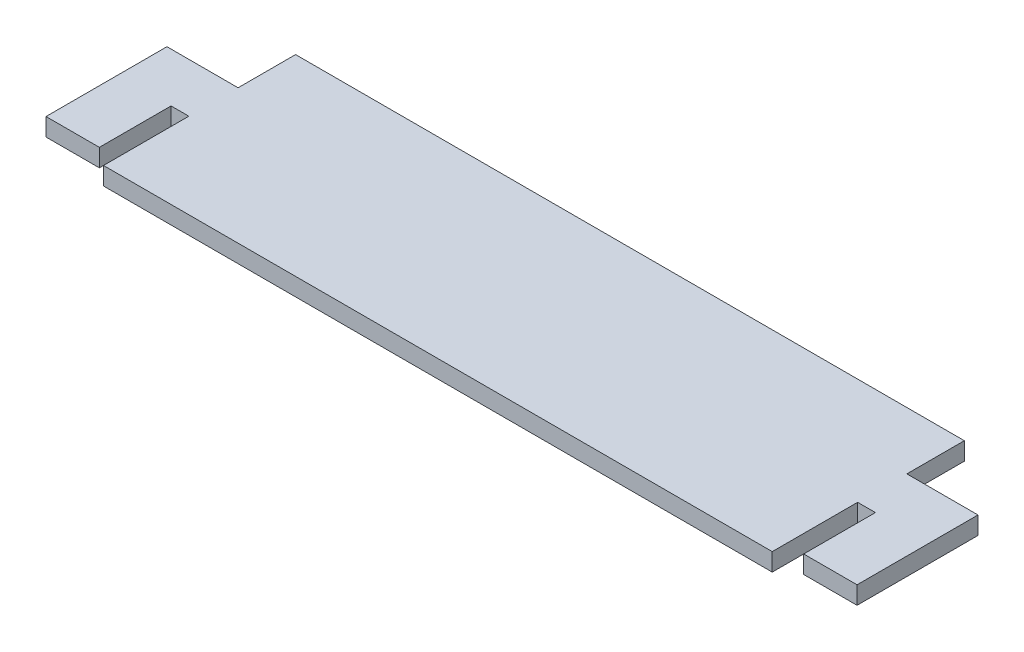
ISO-10303-21;
HEADER;
FILE_DESCRIPTION(('STEP AP214'),'2;1');
FILE_NAME('part.step','',(''),(''),'','','');
FILE_SCHEMA(('AUTOMOTIVE_DESIGN { 1 0 10303 214 1 1 1 1 }'));
ENDSEC;
DATA;
#1=APPLICATION_CONTEXT('core data for automotive mechanical design processes');
#2=APPLICATION_PROTOCOL_DEFINITION('international standard','automotive_design',2000,#1);
#3=PRODUCT_CONTEXT('',#1,'mechanical');
#4=PRODUCT('Part','Part','',(#3));
#5=PRODUCT_RELATED_PRODUCT_CATEGORY('part','',(#4));
#6=PRODUCT_DEFINITION_FORMATION('','',#4);
#7=PRODUCT_DEFINITION_CONTEXT('part definition',#1,'design');
#8=PRODUCT_DEFINITION('design','',#6,#7);
#9=PRODUCT_DEFINITION_SHAPE('','',#8);
#10=(LENGTH_UNIT() NAMED_UNIT(*) SI_UNIT(.MILLI.,.METRE.));
#11=(NAMED_UNIT(*) PLANE_ANGLE_UNIT() SI_UNIT($,.RADIAN.));
#12=(NAMED_UNIT(*) SI_UNIT($,.STERADIAN.) SOLID_ANGLE_UNIT());
#13=UNCERTAINTY_MEASURE_WITH_UNIT(LENGTH_MEASURE(1.E-05),#10,'distance_accuracy_value','');
#14=(GEOMETRIC_REPRESENTATION_CONTEXT(3) GLOBAL_UNCERTAINTY_ASSIGNED_CONTEXT((#13)) GLOBAL_UNIT_ASSIGNED_CONTEXT((#10,
#11,#12)) REPRESENTATION_CONTEXT('',''));
#15=CARTESIAN_POINT('',(0.,0.,0.));
#16=DIRECTION('',(0.,0.,1.));
#17=DIRECTION('',(1.,0.,0.));
#18=AXIS2_PLACEMENT_3D('',#15,#16,#17);
#19=CARTESIAN_POINT('',(-235.,12.5,-67.5));
#20=DIRECTION('',(1.,0.,0.));
#21=DIRECTION('',(0.,0.,-1.));
#22=AXIS2_PLACEMENT_3D('',#19,#20,#21);
#23=PLANE('',#22);
#24=DIRECTION('',(0.,0.,1.));
#25=VECTOR('',#24,1.);
#26=CARTESIAN_POINT('',(-235.,0.,-67.5));
#27=LINE('',#26,#25);
#28=CARTESIAN_POINT('',(-235.,0.,-67.5));
#29=VERTEX_POINT('',#28);
#30=CARTESIAN_POINT('',(-235.,0.,-27.0993930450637));
#31=VERTEX_POINT('',#30);
#32=EDGE_CURVE('E178',#29,#31,#27,.T.);
#33=ORIENTED_EDGE('',*,*,#32,.T.);
#34=DIRECTION('',(0.,-1.,0.));
#35=VECTOR('',#34,1.);
#36=CARTESIAN_POINT('',(-235.,12.5,-27.0993930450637));
#37=LINE('',#36,#35);
#38=CARTESIAN_POINT('',(-235.,12.5,-27.0993930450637));
#39=VERTEX_POINT('',#38);
#40=EDGE_CURVE('E11',#39,#31,#37,.T.);
#41=ORIENTED_EDGE('',*,*,#40,.F.);
#42=DIRECTION('',(0.,0.,1.));
#43=VECTOR('',#42,1.);
#44=CARTESIAN_POINT('',(-235.,12.5,-67.5));
#45=LINE('',#44,#43);
#46=CARTESIAN_POINT('',(-235.,12.5,-67.5));
#47=VERTEX_POINT('',#46);
#48=EDGE_CURVE('E216',#47,#39,#45,.T.);
#49=ORIENTED_EDGE('',*,*,#48,.F.);
#50=DIRECTION('',(0.,-1.,0.));
#51=VECTOR('',#50,1.);
#52=CARTESIAN_POINT('',(-235.,12.5,-67.5));
#53=LINE('',#52,#51);
#54=EDGE_CURVE('E49',#47,#29,#53,.T.);
#55=ORIENTED_EDGE('',*,*,#54,.T.);
#56=EDGE_LOOP('',(#33,#41,#49,#55));
#57=FACE_BOUND('',#56,.T.);
#58=ADVANCED_FACE('F33',(#57),#23,.F.);
#59=CARTESIAN_POINT('',(-235.,12.5,-27.0993930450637));
#60=DIRECTION('',(0.,0.,1.));
#61=DIRECTION('',(1.,0.,0.));
#62=AXIS2_PLACEMENT_3D('',#59,#60,#61);
#63=PLANE('',#62);
#64=DIRECTION('',(-1.,0.,0.));
#65=VECTOR('',#64,1.);
#66=CARTESIAN_POINT('',(-235.,0.,-27.0993930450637));
#67=LINE('',#66,#65);
#68=CARTESIAN_POINT('',(-285.,0.,-27.0993930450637));
#69=VERTEX_POINT('',#68);
#70=EDGE_CURVE('E180',#31,#69,#67,.T.);
#71=ORIENTED_EDGE('',*,*,#70,.T.);
#72=DIRECTION('',(0.,-1.,0.));
#73=VECTOR('',#72,1.);
#74=CARTESIAN_POINT('',(-285.,12.5,-27.0993930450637));
#75=LINE('',#74,#73);
#76=CARTESIAN_POINT('',(-285.,12.5,-27.0993930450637));
#77=VERTEX_POINT('',#76);
#78=EDGE_CURVE('E41',#77,#69,#75,.T.);
#79=ORIENTED_EDGE('',*,*,#78,.F.);
#80=DIRECTION('',(-1.,0.,0.));
#81=VECTOR('',#80,1.);
#82=CARTESIAN_POINT('',(-235.,12.5,-27.0993930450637));
#83=LINE('',#82,#81);
#84=EDGE_CURVE('E111',#39,#77,#83,.T.);
#85=ORIENTED_EDGE('',*,*,#84,.F.);
#86=ORIENTED_EDGE('',*,*,#40,.T.);
#87=EDGE_LOOP('',(#71,#79,#85,#86));
#88=FACE_BOUND('',#87,.T.);
#89=ADVANCED_FACE('F303',(#88),#63,.F.);
#90=CARTESIAN_POINT('',(-285.,12.5,-27.0993930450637));
#91=DIRECTION('',(1.,0.,0.));
#92=DIRECTION('',(0.,0.,-1.));
#93=AXIS2_PLACEMENT_3D('',#90,#91,#92);
#94=PLANE('',#93);
#95=DIRECTION('',(0.,0.,1.));
#96=VECTOR('',#95,1.);
#97=CARTESIAN_POINT('',(-285.,0.,-27.0993930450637));
#98=LINE('',#97,#96);
#99=CARTESIAN_POINT('',(-285.,0.,57.9006069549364));
#100=VERTEX_POINT('',#99);
#101=EDGE_CURVE('E182',#69,#100,#98,.T.);
#102=ORIENTED_EDGE('',*,*,#101,.T.);
#103=DIRECTION('',(0.,-1.,0.));
#104=VECTOR('',#103,1.);
#105=CARTESIAN_POINT('',(-285.,12.5,57.9006069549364));
#106=LINE('',#105,#104);
#107=CARTESIAN_POINT('',(-285.,12.5,57.9006069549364));
#108=VERTEX_POINT('',#107);
#109=EDGE_CURVE('E242',#108,#100,#106,.T.);
#110=ORIENTED_EDGE('',*,*,#109,.F.);
#111=DIRECTION('',(0.,0.,1.));
#112=VECTOR('',#111,1.);
#113=CARTESIAN_POINT('',(-285.,12.5,-27.0993930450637));
#114=LINE('',#113,#112);
#115=EDGE_CURVE('E250',#77,#108,#114,.T.);
#116=ORIENTED_EDGE('',*,*,#115,.F.);
#117=ORIENTED_EDGE('',*,*,#78,.T.);
#118=EDGE_LOOP('',(#102,#110,#116,#117));
#119=FACE_BOUND('',#118,.T.);
#120=ADVANCED_FACE('F248',(#119),#94,.F.);
#121=CARTESIAN_POINT('',(-285.,12.5,57.9006069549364));
#122=DIRECTION('',(0.,0.,-1.));
#123=DIRECTION('',(-1.,0.,0.));
#124=AXIS2_PLACEMENT_3D('',#121,#122,#123);
#125=PLANE('',#124);
#126=DIRECTION('',(1.,0.,0.));
#127=VECTOR('',#126,1.);
#128=CARTESIAN_POINT('',(-285.,0.,57.9006069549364));
#129=LINE('',#128,#127);
#130=CARTESIAN_POINT('',(-247.5,0.,57.9006069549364));
#131=VERTEX_POINT('',#130);
#132=EDGE_CURVE('E184',#100,#131,#129,.T.);
#133=ORIENTED_EDGE('',*,*,#132,.T.);
#134=DIRECTION('',(0.,-1.,0.));
#135=VECTOR('',#134,1.);
#136=CARTESIAN_POINT('',(-247.5,12.5,57.9006069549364));
#137=LINE('',#136,#135);
#138=CARTESIAN_POINT('',(-247.5,12.5,57.9006069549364));
#139=VERTEX_POINT('',#138);
#140=EDGE_CURVE('E239',#139,#131,#137,.T.);
#141=ORIENTED_EDGE('',*,*,#140,.F.);
#142=DIRECTION('',(1.,0.,0.));
#143=VECTOR('',#142,1.);
#144=CARTESIAN_POINT('',(-285.,12.5,57.9006069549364));
#145=LINE('',#144,#143);
#146=EDGE_CURVE('E267',#108,#139,#145,.T.);
#147=ORIENTED_EDGE('',*,*,#146,.F.);
#148=ORIENTED_EDGE('',*,*,#109,.T.);
#149=EDGE_LOOP('',(#133,#141,#147,#148));
#150=FACE_BOUND('',#149,.T.);
#151=ADVANCED_FACE('F258',(#150),#125,.F.);
#152=CARTESIAN_POINT('',(-247.5,12.5,57.9006069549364));
#153=DIRECTION('',(-1.,0.,0.));
#154=DIRECTION('',(0.,0.,1.));
#155=AXIS2_PLACEMENT_3D('',#152,#153,#154);
#156=PLANE('',#155);
#157=DIRECTION('',(0.,0.,-1.));
#158=VECTOR('',#157,1.);
#159=CARTESIAN_POINT('',(-247.5,0.,57.9006069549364));
#160=LINE('',#159,#158);
#161=CARTESIAN_POINT('',(-247.5,0.,7.49999999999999));
#162=VERTEX_POINT('',#161);
#163=EDGE_CURVE('E186',#131,#162,#160,.T.);
#164=ORIENTED_EDGE('',*,*,#163,.T.);
#165=DIRECTION('',(0.,-1.,0.));
#166=VECTOR('',#165,1.);
#167=CARTESIAN_POINT('',(-247.5,12.5,7.49999999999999));
#168=LINE('',#167,#166);
#169=CARTESIAN_POINT('',(-247.5,12.5,7.49999999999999));
#170=VERTEX_POINT('',#169);
#171=EDGE_CURVE('E236',#170,#162,#168,.T.);
#172=ORIENTED_EDGE('',*,*,#171,.F.);
#173=DIRECTION('',(0.,0.,-1.));
#174=VECTOR('',#173,1.);
#175=CARTESIAN_POINT('',(-247.5,12.5,57.9006069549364));
#176=LINE('',#175,#174);
#177=EDGE_CURVE('E264',#139,#170,#176,.T.);
#178=ORIENTED_EDGE('',*,*,#177,.F.);
#179=ORIENTED_EDGE('',*,*,#140,.T.);
#180=EDGE_LOOP('',(#164,#172,#178,#179));
#181=FACE_BOUND('',#180,.T.);
#182=ADVANCED_FACE('F262',(#181),#156,.F.);
#183=CARTESIAN_POINT('',(-247.5,12.5,7.49999999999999));
#184=DIRECTION('',(0.,0.,-1.));
#185=DIRECTION('',(-1.,0.,0.));
#186=AXIS2_PLACEMENT_3D('',#183,#184,#185);
#187=PLANE('',#186);
#188=DIRECTION('',(1.,0.,0.));
#189=VECTOR('',#188,1.);
#190=CARTESIAN_POINT('',(-247.5,0.,7.49999999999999));
#191=LINE('',#190,#189);
#192=CARTESIAN_POINT('',(-235.,0.,7.49999999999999));
#193=VERTEX_POINT('',#192);
#194=EDGE_CURVE('E188',#162,#193,#191,.T.);
#195=ORIENTED_EDGE('',*,*,#194,.T.);
#196=DIRECTION('',(0.,-1.,0.));
#197=VECTOR('',#196,1.);
#198=CARTESIAN_POINT('',(-235.,12.5,7.49999999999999));
#199=LINE('',#198,#197);
#200=CARTESIAN_POINT('',(-235.,12.5,7.49999999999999));
#201=VERTEX_POINT('',#200);
#202=EDGE_CURVE('E233',#201,#193,#199,.T.);
#203=ORIENTED_EDGE('',*,*,#202,.F.);
#204=DIRECTION('',(1.,0.,0.));
#205=VECTOR('',#204,1.);
#206=CARTESIAN_POINT('',(-247.5,12.5,7.49999999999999));
#207=LINE('',#206,#205);
#208=EDGE_CURVE('E266',#170,#201,#207,.T.);
#209=ORIENTED_EDGE('',*,*,#208,.F.);
#210=ORIENTED_EDGE('',*,*,#171,.T.);
#211=EDGE_LOOP('',(#195,#203,#209,#210));
#212=FACE_BOUND('',#211,.T.);
#213=ADVANCED_FACE('F319',(#212),#187,.F.);
#214=CARTESIAN_POINT('',(-235.,12.5,7.49999999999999));
#215=DIRECTION('',(1.,0.,0.));
#216=DIRECTION('',(0.,0.,-1.));
#217=AXIS2_PLACEMENT_3D('',#214,#215,#216);
#218=PLANE('',#217);
#219=DIRECTION('',(0.,0.,1.));
#220=VECTOR('',#219,1.);
#221=CARTESIAN_POINT('',(-235.,0.,7.49999999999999));
#222=LINE('',#221,#220);
#223=CARTESIAN_POINT('',(-235.,0.,67.5));
#224=VERTEX_POINT('',#223);
#225=EDGE_CURVE('E190',#193,#224,#222,.T.);
#226=ORIENTED_EDGE('',*,*,#225,.T.);
#227=DIRECTION('',(0.,-1.,0.));
#228=VECTOR('',#227,1.);
#229=CARTESIAN_POINT('',(-235.,12.5,67.5));
#230=LINE('',#229,#228);
#231=CARTESIAN_POINT('',(-235.,12.5,67.5));
#232=VERTEX_POINT('',#231);
#233=EDGE_CURVE('E230',#232,#224,#230,.T.);
#234=ORIENTED_EDGE('',*,*,#233,.F.);
#235=DIRECTION('',(0.,0.,1.));
#236=VECTOR('',#235,1.);
#237=CARTESIAN_POINT('',(-235.,12.5,7.49999999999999));
#238=LINE('',#237,#236);
#239=EDGE_CURVE('E269',#201,#232,#238,.T.);
#240=ORIENTED_EDGE('',*,*,#239,.F.);
#241=ORIENTED_EDGE('',*,*,#202,.T.);
#242=EDGE_LOOP('',(#226,#234,#240,#241));
#243=FACE_BOUND('',#242,.T.);
#244=ADVANCED_FACE('F322',(#243),#218,.F.);
#245=CARTESIAN_POINT('',(-235.,12.5,67.5));
#246=DIRECTION('',(0.,0.,-1.));
#247=DIRECTION('',(-1.,0.,0.));
#248=AXIS2_PLACEMENT_3D('',#245,#246,#247);
#249=PLANE('',#248);
#250=DIRECTION('',(1.,0.,0.));
#251=VECTOR('',#250,1.);
#252=CARTESIAN_POINT('',(-235.,0.,67.5));
#253=LINE('',#252,#251);
#254=CARTESIAN_POINT('',(235.,0.,67.4999999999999));
#255=VERTEX_POINT('',#254);
#256=EDGE_CURVE('E192',#224,#255,#253,.T.);
#257=ORIENTED_EDGE('',*,*,#256,.T.);
#258=DIRECTION('',(0.,-1.,0.));
#259=VECTOR('',#258,1.);
#260=CARTESIAN_POINT('',(235.,12.5,67.4999999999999));
#261=LINE('',#260,#259);
#262=CARTESIAN_POINT('',(235.,12.5,67.4999999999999));
#263=VERTEX_POINT('',#262);
#264=EDGE_CURVE('E228',#263,#255,#261,.T.);
#265=ORIENTED_EDGE('',*,*,#264,.F.);
#266=DIRECTION('',(1.,0.,0.));
#267=VECTOR('',#266,1.);
#268=CARTESIAN_POINT('',(-235.,12.5,67.5));
#269=LINE('',#268,#267);
#270=EDGE_CURVE('E275',#232,#263,#269,.T.);
#271=ORIENTED_EDGE('',*,*,#270,.F.);
#272=ORIENTED_EDGE('',*,*,#233,.T.);
#273=EDGE_LOOP('',(#257,#265,#271,#272));
#274=FACE_BOUND('',#273,.T.);
#275=ADVANCED_FACE('F326',(#274),#249,.F.);
#276=CARTESIAN_POINT('',(235.,12.5,7.49999999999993));
#277=DIRECTION('',(1.,0.,0.));
#278=DIRECTION('',(0.,0.,-1.));
#279=AXIS2_PLACEMENT_3D('',#276,#277,#278);
#280=PLANE('',#279);
#281=DIRECTION('',(0.,0.,1.));
#282=VECTOR('',#281,1.);
#283=CARTESIAN_POINT('',(235.,0.,7.49999999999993));
#284=LINE('',#283,#282);
#285=CARTESIAN_POINT('',(235.,0.,7.49999999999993));
#286=VERTEX_POINT('',#285);
#287=EDGE_CURVE('E195',#286,#255,#284,.T.);
#288=ORIENTED_EDGE('',*,*,#287,.F.);
#289=DIRECTION('',(0.,-1.,0.));
#290=VECTOR('',#289,1.);
#291=CARTESIAN_POINT('',(235.,12.5,7.49999999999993));
#292=LINE('',#291,#290);
#293=CARTESIAN_POINT('',(235.,12.5,7.49999999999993));
#294=VERTEX_POINT('',#293);
#295=EDGE_CURVE('E226',#294,#286,#292,.T.);
#296=ORIENTED_EDGE('',*,*,#295,.F.);
#297=DIRECTION('',(0.,0.,1.));
#298=VECTOR('',#297,1.);
#299=CARTESIAN_POINT('',(235.,12.5,7.49999999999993));
#300=LINE('',#299,#298);
#301=EDGE_CURVE('E277',#294,#263,#300,.T.);
#302=ORIENTED_EDGE('',*,*,#301,.T.);
#303=ORIENTED_EDGE('',*,*,#264,.T.);
#304=EDGE_LOOP('',(#288,#296,#302,#303));
#305=FACE_BOUND('',#304,.T.);
#306=ADVANCED_FACE('F330',(#305),#280,.T.);
#307=CARTESIAN_POINT('',(247.5,12.5,7.49999999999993));
#308=DIRECTION('',(0.,0.,1.));
#309=DIRECTION('',(1.,0.,0.));
#310=AXIS2_PLACEMENT_3D('',#307,#308,#309);
#311=PLANE('',#310);
#312=DIRECTION('',(-1.,0.,0.));
#313=VECTOR('',#312,1.);
#314=CARTESIAN_POINT('',(247.5,0.,7.49999999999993));
#315=LINE('',#314,#313);
#316=CARTESIAN_POINT('',(247.5,0.,7.49999999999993));
#317=VERTEX_POINT('',#316);
#318=EDGE_CURVE('E198',#317,#286,#315,.T.);
#319=ORIENTED_EDGE('',*,*,#318,.F.);
#320=DIRECTION('',(0.,-1.,0.));
#321=VECTOR('',#320,1.);
#322=CARTESIAN_POINT('',(247.5,12.5,7.49999999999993));
#323=LINE('',#322,#321);
#324=CARTESIAN_POINT('',(247.5,12.5,7.49999999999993));
#325=VERTEX_POINT('',#324);
#326=EDGE_CURVE('E224',#325,#317,#323,.T.);
#327=ORIENTED_EDGE('',*,*,#326,.F.);
#328=DIRECTION('',(-1.,0.,0.));
#329=VECTOR('',#328,1.);
#330=CARTESIAN_POINT('',(247.5,12.5,7.49999999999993));
#331=LINE('',#330,#329);
#332=EDGE_CURVE('E280',#325,#294,#331,.T.);
#333=ORIENTED_EDGE('',*,*,#332,.T.);
#334=ORIENTED_EDGE('',*,*,#295,.T.);
#335=EDGE_LOOP('',(#319,#327,#333,#334));
#336=FACE_BOUND('',#335,.T.);
#337=ADVANCED_FACE('F334',(#336),#311,.T.);
#338=CARTESIAN_POINT('',(247.5,12.5,57.9006069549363));
#339=DIRECTION('',(-1.,0.,0.));
#340=DIRECTION('',(0.,0.,1.));
#341=AXIS2_PLACEMENT_3D('',#338,#339,#340);
#342=PLANE('',#341);
#343=DIRECTION('',(0.,0.,-1.));
#344=VECTOR('',#343,1.);
#345=CARTESIAN_POINT('',(247.5,0.,57.9006069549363));
#346=LINE('',#345,#344);
#347=CARTESIAN_POINT('',(247.5,0.,57.9006069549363));
#348=VERTEX_POINT('',#347);
#349=EDGE_CURVE('E201',#348,#317,#346,.T.);
#350=ORIENTED_EDGE('',*,*,#349,.F.);
#351=DIRECTION('',(0.,-1.,0.));
#352=VECTOR('',#351,1.);
#353=CARTESIAN_POINT('',(247.5,12.5,57.9006069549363));
#354=LINE('',#353,#352);
#355=CARTESIAN_POINT('',(247.5,12.5,57.9006069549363));
#356=VERTEX_POINT('',#355);
#357=EDGE_CURVE('E222',#356,#348,#354,.T.);
#358=ORIENTED_EDGE('',*,*,#357,.F.);
#359=DIRECTION('',(0.,0.,-1.));
#360=VECTOR('',#359,1.);
#361=CARTESIAN_POINT('',(247.5,12.5,57.9006069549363));
#362=LINE('',#361,#360);
#363=EDGE_CURVE('E283',#356,#325,#362,.T.);
#364=ORIENTED_EDGE('',*,*,#363,.T.);
#365=ORIENTED_EDGE('',*,*,#326,.T.);
#366=EDGE_LOOP('',(#350,#358,#364,#365));
#367=FACE_BOUND('',#366,.T.);
#368=ADVANCED_FACE('F338',(#367),#342,.T.);
#369=CARTESIAN_POINT('',(285.,12.5,57.9006069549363));
#370=DIRECTION('',(0.,0.,1.));
#371=DIRECTION('',(1.,0.,0.));
#372=AXIS2_PLACEMENT_3D('',#369,#370,#371);
#373=PLANE('',#372);
#374=DIRECTION('',(-1.,0.,0.));
#375=VECTOR('',#374,1.);
#376=CARTESIAN_POINT('',(285.,0.,57.9006069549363));
#377=LINE('',#376,#375);
#378=CARTESIAN_POINT('',(285.,0.,57.9006069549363));
#379=VERTEX_POINT('',#378);
#380=EDGE_CURVE('E204',#379,#348,#377,.T.);
#381=ORIENTED_EDGE('',*,*,#380,.F.);
#382=DIRECTION('',(0.,-1.,0.));
#383=VECTOR('',#382,1.);
#384=CARTESIAN_POINT('',(285.,12.5,57.9006069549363));
#385=LINE('',#384,#383);
#386=CARTESIAN_POINT('',(285.,12.5,57.9006069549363));
#387=VERTEX_POINT('',#386);
#388=EDGE_CURVE('E220',#387,#379,#385,.T.);
#389=ORIENTED_EDGE('',*,*,#388,.F.);
#390=DIRECTION('',(-1.,0.,0.));
#391=VECTOR('',#390,1.);
#392=CARTESIAN_POINT('',(285.,12.5,57.9006069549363));
#393=LINE('',#392,#391);
#394=EDGE_CURVE('E286',#387,#356,#393,.T.);
#395=ORIENTED_EDGE('',*,*,#394,.T.);
#396=ORIENTED_EDGE('',*,*,#357,.T.);
#397=EDGE_LOOP('',(#381,#389,#395,#396));
#398=FACE_BOUND('',#397,.T.);
#399=ADVANCED_FACE('F342',(#398),#373,.T.);
#400=CARTESIAN_POINT('',(285.,12.5,-27.0993930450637));
#401=DIRECTION('',(1.,0.,0.));
#402=DIRECTION('',(0.,0.,-1.));
#403=AXIS2_PLACEMENT_3D('',#400,#401,#402);
#404=PLANE('',#403);
#405=DIRECTION('',(0.,0.,1.));
#406=VECTOR('',#405,1.);
#407=CARTESIAN_POINT('',(285.,0.,-27.0993930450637));
#408=LINE('',#407,#406);
#409=CARTESIAN_POINT('',(285.,0.,-27.0993930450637));
#410=VERTEX_POINT('',#409);
#411=EDGE_CURVE('E207',#410,#379,#408,.T.);
#412=ORIENTED_EDGE('',*,*,#411,.F.);
#413=DIRECTION('',(0.,-1.,0.));
#414=VECTOR('',#413,1.);
#415=CARTESIAN_POINT('',(285.,12.5,-27.0993930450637));
#416=LINE('',#415,#414);
#417=CARTESIAN_POINT('',(285.,12.5,-27.0993930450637));
#418=VERTEX_POINT('',#417);
#419=EDGE_CURVE('E160',#418,#410,#416,.T.);
#420=ORIENTED_EDGE('',*,*,#419,.F.);
#421=DIRECTION('',(0.,0.,1.));
#422=VECTOR('',#421,1.);
#423=CARTESIAN_POINT('',(285.,12.5,-27.0993930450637));
#424=LINE('',#423,#422);
#425=EDGE_CURVE('E170',#418,#387,#424,.T.);
#426=ORIENTED_EDGE('',*,*,#425,.T.);
#427=ORIENTED_EDGE('',*,*,#388,.T.);
#428=EDGE_LOOP('',(#412,#420,#426,#427));
#429=FACE_BOUND('',#428,.T.);
#430=ADVANCED_FACE('F290',(#429),#404,.T.);
#431=CARTESIAN_POINT('',(235.,12.5,-27.0993930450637));
#432=DIRECTION('',(0.,0.,-1.));
#433=DIRECTION('',(-1.,0.,0.));
#434=AXIS2_PLACEMENT_3D('',#431,#432,#433);
#435=PLANE('',#434);
#436=DIRECTION('',(1.,0.,0.));
#437=VECTOR('',#436,1.);
#438=CARTESIAN_POINT('',(235.,0.,-27.0993930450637));
#439=LINE('',#438,#437);
#440=CARTESIAN_POINT('',(235.,0.,-27.0993930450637));
#441=VERTEX_POINT('',#440);
#442=EDGE_CURVE('E156',#441,#410,#439,.T.);
#443=ORIENTED_EDGE('',*,*,#442,.F.);
#444=DIRECTION('',(0.,-1.,0.));
#445=VECTOR('',#444,1.);
#446=CARTESIAN_POINT('',(235.,12.5,-27.0993930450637));
#447=LINE('',#446,#445);
#448=CARTESIAN_POINT('',(235.,12.5,-27.0993930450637));
#449=VERTEX_POINT('',#448);
#450=EDGE_CURVE('E151',#449,#441,#447,.T.);
#451=ORIENTED_EDGE('',*,*,#450,.F.);
#452=DIRECTION('',(1.,0.,0.));
#453=VECTOR('',#452,1.);
#454=CARTESIAN_POINT('',(235.,12.5,-27.0993930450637));
#455=LINE('',#454,#453);
#456=EDGE_CURVE('E154',#449,#418,#455,.T.);
#457=ORIENTED_EDGE('',*,*,#456,.T.);
#458=ORIENTED_EDGE('',*,*,#419,.T.);
#459=EDGE_LOOP('',(#443,#451,#457,#458));
#460=FACE_BOUND('',#459,.T.);
#461=ADVANCED_FACE('F153',(#460),#435,.T.);
#462=CARTESIAN_POINT('',(235.,12.5,-67.5000000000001));
#463=DIRECTION('',(1.,0.,0.));
#464=DIRECTION('',(0.,0.,-1.));
#465=AXIS2_PLACEMENT_3D('',#462,#463,#464);
#466=PLANE('',#465);
#467=DIRECTION('',(0.,0.,1.));
#468=VECTOR('',#467,1.);
#469=CARTESIAN_POINT('',(235.,0.,-67.5000000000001));
#470=LINE('',#469,#468);
#471=CARTESIAN_POINT('',(235.,0.,-67.5000000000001));
#472=VERTEX_POINT('',#471);
#473=EDGE_CURVE('E211',#472,#441,#470,.T.);
#474=ORIENTED_EDGE('',*,*,#473,.F.);
#475=DIRECTION('',(0.,-1.,0.));
#476=VECTOR('',#475,1.);
#477=CARTESIAN_POINT('',(235.,12.5,-67.5000000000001));
#478=LINE('',#477,#476);
#479=CARTESIAN_POINT('',(235.,12.5,-67.5000000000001));
#480=VERTEX_POINT('',#479);
#481=EDGE_CURVE('E99',#480,#472,#478,.T.);
#482=ORIENTED_EDGE('',*,*,#481,.F.);
#483=DIRECTION('',(0.,0.,1.));
#484=VECTOR('',#483,1.);
#485=CARTESIAN_POINT('',(235.,12.5,-67.5000000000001));
#486=LINE('',#485,#484);
#487=EDGE_CURVE('E167',#480,#449,#486,.T.);
#488=ORIENTED_EDGE('',*,*,#487,.T.);
#489=ORIENTED_EDGE('',*,*,#450,.T.);
#490=EDGE_LOOP('',(#474,#482,#488,#489));
#491=FACE_BOUND('',#490,.T.);
#492=ADVANCED_FACE('F172',(#491),#466,.T.);
#493=CARTESIAN_POINT('',(-235.,12.5,-67.5));
#494=DIRECTION('',(0.,0.,-1.));
#495=DIRECTION('',(-1.,0.,0.));
#496=AXIS2_PLACEMENT_3D('',#493,#494,#495);
#497=PLANE('',#496);
#498=DIRECTION('',(1.,0.,0.));
#499=VECTOR('',#498,1.);
#500=CARTESIAN_POINT('',(-235.,0.,-67.5));
#501=LINE('',#500,#499);
#502=EDGE_CURVE('E213',#29,#472,#501,.T.);
#503=ORIENTED_EDGE('',*,*,#502,.F.);
#504=ORIENTED_EDGE('',*,*,#54,.F.);
#505=DIRECTION('',(1.,0.,0.));
#506=VECTOR('',#505,1.);
#507=CARTESIAN_POINT('',(-235.,12.5,-67.5));
#508=LINE('',#507,#506);
#509=EDGE_CURVE('E173',#47,#480,#508,.T.);
#510=ORIENTED_EDGE('',*,*,#509,.T.);
#511=ORIENTED_EDGE('',*,*,#481,.T.);
#512=EDGE_LOOP('',(#503,#504,#510,#511));
#513=FACE_BOUND('',#512,.T.);
#514=ADVANCED_FACE('F292',(#513),#497,.T.);
#515=CARTESIAN_POINT('',(0.,12.5,0.));
#516=DIRECTION('',(0.,-1.,0.));
#517=DIRECTION('',(0.,0.,-1.));
#518=AXIS2_PLACEMENT_3D('',#515,#516,#517);
#519=PLANE('',#518);
#520=ORIENTED_EDGE('',*,*,#48,.T.);
#521=ORIENTED_EDGE('',*,*,#84,.T.);
#522=ORIENTED_EDGE('',*,*,#115,.T.);
#523=ORIENTED_EDGE('',*,*,#146,.T.);
#524=ORIENTED_EDGE('',*,*,#177,.T.);
#525=ORIENTED_EDGE('',*,*,#208,.T.);
#526=ORIENTED_EDGE('',*,*,#239,.T.);
#527=ORIENTED_EDGE('',*,*,#270,.T.);
#528=ORIENTED_EDGE('',*,*,#301,.F.);
#529=ORIENTED_EDGE('',*,*,#332,.F.);
#530=ORIENTED_EDGE('',*,*,#363,.F.);
#531=ORIENTED_EDGE('',*,*,#394,.F.);
#532=ORIENTED_EDGE('',*,*,#425,.F.);
#533=ORIENTED_EDGE('',*,*,#456,.F.);
#534=ORIENTED_EDGE('',*,*,#487,.F.);
#535=ORIENTED_EDGE('',*,*,#509,.F.);
#536=EDGE_LOOP('',(#520,#521,#522,#523,#524,#525,#526,#527,#528,#529,#530,#531,#532,#533,#534,#535));
#537=FACE_BOUND('',#536,.T.);
#538=ADVANCED_FACE('F165',(#537),#519,.F.);
#539=CARTESIAN_POINT('',(0.,0.,0.));
#540=DIRECTION('',(0.,-1.,0.));
#541=DIRECTION('',(0.,0.,-1.));
#542=AXIS2_PLACEMENT_3D('',#539,#540,#541);
#543=PLANE('',#542);
#544=ORIENTED_EDGE('',*,*,#32,.F.);
#545=ORIENTED_EDGE('',*,*,#502,.T.);
#546=ORIENTED_EDGE('',*,*,#473,.T.);
#547=ORIENTED_EDGE('',*,*,#442,.T.);
#548=ORIENTED_EDGE('',*,*,#411,.T.);
#549=ORIENTED_EDGE('',*,*,#380,.T.);
#550=ORIENTED_EDGE('',*,*,#349,.T.);
#551=ORIENTED_EDGE('',*,*,#318,.T.);
#552=ORIENTED_EDGE('',*,*,#287,.T.);
#553=ORIENTED_EDGE('',*,*,#256,.F.);
#554=ORIENTED_EDGE('',*,*,#225,.F.);
#555=ORIENTED_EDGE('',*,*,#194,.F.);
#556=ORIENTED_EDGE('',*,*,#163,.F.);
#557=ORIENTED_EDGE('',*,*,#132,.F.);
#558=ORIENTED_EDGE('',*,*,#101,.F.);
#559=ORIENTED_EDGE('',*,*,#70,.F.);
#560=EDGE_LOOP('',(#544,#545,#546,#547,#548,#549,#550,#551,#552,#553,#554,#555,#556,#557,#558,#559));
#561=FACE_BOUND('',#560,.T.);
#562=ADVANCED_FACE('F253',(#561),#543,.T.);
#563=CLOSED_SHELL('',(#58,#89,#120,#151,#182,#213,#244,#275,#306,#337,#368,#399,#430,#461,#492,
#514,#538,#562));
#564=MANIFOLD_SOLID_BREP('B2',#563);
#565=ADVANCED_BREP_SHAPE_REPRESENTATION('',(#18,#564),#14);
#566=SHAPE_DEFINITION_REPRESENTATION(#9,#565);
ENDSEC;
END-ISO-10303-21;
